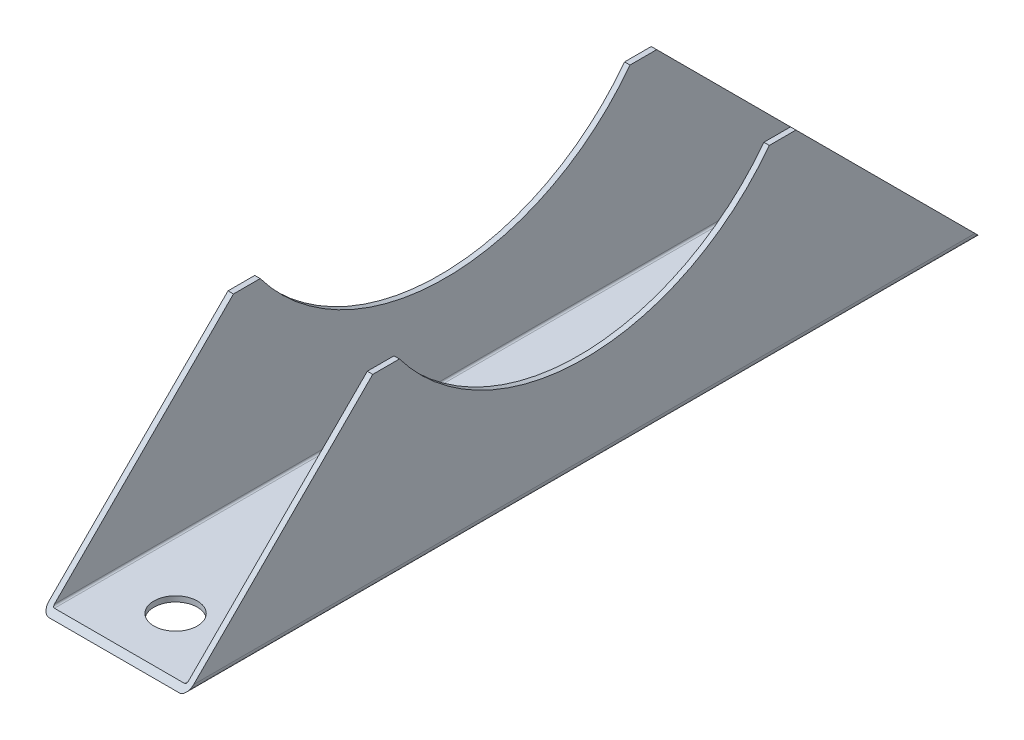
ISO-10303-21;
HEADER;
FILE_DESCRIPTION(('STEP AP214'),'2;1');
FILE_NAME('part.step','',(''),(''),'','','');
FILE_SCHEMA(('AUTOMOTIVE_DESIGN { 1 0 10303 214 1 1 1 1 }'));
ENDSEC;
DATA;
#1=APPLICATION_CONTEXT('core data for automotive mechanical design processes');
#2=APPLICATION_PROTOCOL_DEFINITION('international standard','automotive_design',2000,#1);
#3=PRODUCT_CONTEXT('',#1,'mechanical');
#4=PRODUCT('Part','Part','',(#3));
#5=PRODUCT_RELATED_PRODUCT_CATEGORY('part','',(#4));
#6=PRODUCT_DEFINITION_FORMATION('','',#4);
#7=PRODUCT_DEFINITION_CONTEXT('part definition',#1,'design');
#8=PRODUCT_DEFINITION('design','',#6,#7);
#9=PRODUCT_DEFINITION_SHAPE('','',#8);
#10=(LENGTH_UNIT() NAMED_UNIT(*) SI_UNIT(.MILLI.,.METRE.));
#11=(NAMED_UNIT(*) PLANE_ANGLE_UNIT() SI_UNIT($,.RADIAN.));
#12=(NAMED_UNIT(*) SI_UNIT($,.STERADIAN.) SOLID_ANGLE_UNIT());
#13=UNCERTAINTY_MEASURE_WITH_UNIT(LENGTH_MEASURE(1.E-05),#10,'distance_accuracy_value','');
#14=(GEOMETRIC_REPRESENTATION_CONTEXT(3) GLOBAL_UNCERTAINTY_ASSIGNED_CONTEXT((#13)) GLOBAL_UNIT_ASSIGNED_CONTEXT((#10,
#11,#12)) REPRESENTATION_CONTEXT('',''));
#15=CARTESIAN_POINT('',(0.,0.,0.));
#16=DIRECTION('',(0.,0.,1.));
#17=DIRECTION('',(1.,0.,0.));
#18=AXIS2_PLACEMENT_3D('',#15,#16,#17);
#19=CARTESIAN_POINT('',(18.5,51.5,110.));
#20=DIRECTION('',(0.,-1.,0.));
#21=DIRECTION('',(0.,0.,-1.));
#22=AXIS2_PLACEMENT_3D('',#19,#20,#21);
#23=PLANE('',#22);
#24=DIRECTION('',(0.,0.,-1.));
#25=VECTOR('',#24,1.);
#26=CARTESIAN_POINT('',(18.5,51.5,110.));
#27=LINE('',#26,#25);
#28=CARTESIAN_POINT('',(18.5,51.5,-51.1248471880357));
#29=VERTEX_POINT('',#28);
#30=CARTESIAN_POINT('',(18.5,51.5,-58.5000000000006));
#31=VERTEX_POINT('',#30);
#32=EDGE_CURVE('E181',#29,#31,#27,.T.);
#33=ORIENTED_EDGE('',*,*,#32,.F.);
#34=DIRECTION('',(1.,0.,0.));
#35=VECTOR('',#34,1.);
#36=CARTESIAN_POINT('',(-20.0000000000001,51.5,-51.1248471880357));
#37=LINE('',#36,#35);
#38=CARTESIAN_POINT('',(20.,51.5,-51.1248471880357));
#39=VERTEX_POINT('',#38);
#40=EDGE_CURVE('E155',#29,#39,#37,.T.);
#41=ORIENTED_EDGE('',*,*,#40,.T.);
#42=DIRECTION('',(0.,0.,-1.));
#43=VECTOR('',#42,1.);
#44=CARTESIAN_POINT('',(20.,51.5,110.));
#45=LINE('',#44,#43);
#46=CARTESIAN_POINT('',(20.,51.5,-58.5000000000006));
#47=VERTEX_POINT('',#46);
#48=EDGE_CURVE('E185',#39,#47,#45,.T.);
#49=ORIENTED_EDGE('',*,*,#48,.T.);
#50=DIRECTION('',(1.,0.,0.));
#51=VECTOR('',#50,1.);
#52=CARTESIAN_POINT('',(-20.0000000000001,51.5,-58.5000000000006));
#53=LINE('',#52,#51);
#54=EDGE_CURVE('E275',#31,#47,#53,.T.);
#55=ORIENTED_EDGE('',*,*,#54,.F.);
#56=EDGE_LOOP('',(#33,#41,#49,#55));
#57=FACE_BOUND('',#56,.T.);
#58=ADVANCED_FACE('F32',(#57),#23,.F.);
#59=CARTESIAN_POINT('',(-20.,51.5,110.));
#60=DIRECTION('',(0.,-1.,0.));
#61=DIRECTION('',(0.,0.,-1.));
#62=AXIS2_PLACEMENT_3D('',#59,#60,#61);
#63=PLANE('',#62);
#64=DIRECTION('',(0.,0.,-1.));
#65=VECTOR('',#64,1.);
#66=CARTESIAN_POINT('',(-20.,51.5,110.));
#67=LINE('',#66,#65);
#68=CARTESIAN_POINT('',(-20.,51.5,-51.1248471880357));
#69=VERTEX_POINT('',#68);
#70=CARTESIAN_POINT('',(-20.0000000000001,51.5,-58.5000000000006));
#71=VERTEX_POINT('',#70);
#72=EDGE_CURVE('E173',#69,#71,#67,.T.);
#73=ORIENTED_EDGE('',*,*,#72,.F.);
#74=CARTESIAN_POINT('',(-18.5,51.5,-51.1248471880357));
#75=VERTEX_POINT('',#74);
#76=EDGE_CURVE('E151',#69,#75,#37,.T.);
#77=ORIENTED_EDGE('',*,*,#76,.T.);
#78=DIRECTION('',(0.,0.,-1.));
#79=VECTOR('',#78,1.);
#80=CARTESIAN_POINT('',(-18.5,51.5,110.));
#81=LINE('',#80,#79);
#82=CARTESIAN_POINT('',(-18.5,51.5,-58.5000000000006));
#83=VERTEX_POINT('',#82);
#84=EDGE_CURVE('E172',#75,#83,#81,.T.);
#85=ORIENTED_EDGE('',*,*,#84,.T.);
#86=EDGE_CURVE('E272',#71,#83,#53,.T.);
#87=ORIENTED_EDGE('',*,*,#86,.F.);
#88=EDGE_LOOP('',(#73,#77,#85,#87));
#89=FACE_BOUND('',#88,.T.);
#90=ADVANCED_FACE('F328',(#89),#63,.F.);
#91=CARTESIAN_POINT('',(-18.5,1.49999999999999,110.));
#92=DIRECTION('',(0.,-1.,0.));
#93=DIRECTION('',(1.,0.,0.));
#94=AXIS2_PLACEMENT_3D('',#91,#92,#93);
#95=PLANE('',#94);
#96=DIRECTION('',(1.,0.,0.));
#97=VECTOR('',#96,1.);
#98=CARTESIAN_POINT('',(-18.5,1.49999999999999,108.5));
#99=LINE('',#98,#97);
#100=CARTESIAN_POINT('',(-18.,1.49999999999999,108.5));
#101=VERTEX_POINT('',#100);
#102=CARTESIAN_POINT('',(18.,1.50000000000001,108.5));
#103=VERTEX_POINT('',#102);
#104=EDGE_CURVE('E245',#101,#103,#99,.T.);
#105=ORIENTED_EDGE('',*,*,#104,.T.);
#106=DIRECTION('',(0.,0.,-1.));
#107=VECTOR('',#106,1.);
#108=CARTESIAN_POINT('',(18.,1.50000000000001,-108.5));
#109=LINE('',#108,#107);
#110=CARTESIAN_POINT('',(18.,1.50000000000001,-108.5));
#111=VERTEX_POINT('',#110);
#112=EDGE_CURVE('E191',#103,#111,#109,.T.);
#113=ORIENTED_EDGE('',*,*,#112,.T.);
#114=DIRECTION('',(1.,0.,0.));
#115=VECTOR('',#114,1.);
#116=CARTESIAN_POINT('',(-18.5,1.49999999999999,-108.5));
#117=LINE('',#116,#115);
#118=CARTESIAN_POINT('',(-18.,1.49999999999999,-108.5));
#119=VERTEX_POINT('',#118);
#120=EDGE_CURVE('E266',#119,#111,#117,.T.);
#121=ORIENTED_EDGE('',*,*,#120,.F.);
#122=DIRECTION('',(0.,0.,-1.));
#123=VECTOR('',#122,1.);
#124=CARTESIAN_POINT('',(-18.,1.49999999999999,108.5));
#125=LINE('',#124,#123);
#126=EDGE_CURVE('E189',#119,#101,#125,.F.);
#127=ORIENTED_EDGE('',*,*,#126,.T.);
#128=EDGE_LOOP('',(#105,#113,#121,#127));
#129=FACE_BOUND('',#128,.T.);
#130=CARTESIAN_POINT('',(0.,1.5,93.));
#131=DIRECTION('',(0.,1.,0.));
#132=DIRECTION('',(-1.,0.,0.));
#133=AXIS2_PLACEMENT_3D('',#130,#131,#132);
#134=CIRCLE('',#133,6.);
#135=CARTESIAN_POINT('',(-6.,1.5,93.));
#136=VERTEX_POINT('',#135);
#137=EDGE_CURVE('E261',#136,#136,#134,.T.);
#138=ORIENTED_EDGE('',*,*,#137,.F.);
#139=EDGE_LOOP('',(#138));
#140=FACE_BOUND('',#139,.T.);
#141=CARTESIAN_POINT('',(0.,1.5,-93.));
#142=DIRECTION('',(0.,-1.,0.));
#143=DIRECTION('',(-1.,0.,0.));
#144=AXIS2_PLACEMENT_3D('',#141,#142,#143);
#145=CIRCLE('',#144,6.);
#146=CARTESIAN_POINT('',(-6.,1.5,-93.));
#147=VERTEX_POINT('',#146);
#148=EDGE_CURVE('E278',#147,#147,#145,.T.);
#149=ORIENTED_EDGE('',*,*,#148,.T.);
#150=EDGE_LOOP('',(#149));
#151=FACE_BOUND('',#150,.T.);
#152=ADVANCED_FACE('F313',(#129,#140,#151),#95,.F.);
#153=CARTESIAN_POINT('',(20.,0.,110.));
#154=DIRECTION('',(0.,1.,0.));
#155=DIRECTION('',(-1.,0.,0.));
#156=AXIS2_PLACEMENT_3D('',#153,#154,#155);
#157=PLANE('',#156);
#158=DIRECTION('',(1.,0.,0.));
#159=VECTOR('',#158,1.);
#160=CARTESIAN_POINT('',(20.,0.,-110.));
#161=LINE('',#160,#159);
#162=CARTESIAN_POINT('',(-18.,0.,-110.));
#163=VERTEX_POINT('',#162);
#164=CARTESIAN_POINT('',(18.,0.,-110.));
#165=VERTEX_POINT('',#164);
#166=EDGE_CURVE('E178',#163,#165,#161,.T.);
#167=ORIENTED_EDGE('',*,*,#166,.T.);
#168=DIRECTION('',(0.,0.,-1.));
#169=VECTOR('',#168,1.);
#170=CARTESIAN_POINT('',(18.,0.,110.));
#171=LINE('',#170,#169);
#172=CARTESIAN_POINT('',(18.,0.,110.));
#173=VERTEX_POINT('',#172);
#174=EDGE_CURVE('E53',#165,#173,#171,.F.);
#175=ORIENTED_EDGE('',*,*,#174,.T.);
#176=DIRECTION('',(1.,0.,0.));
#177=VECTOR('',#176,1.);
#178=CARTESIAN_POINT('',(20.,0.,110.));
#179=LINE('',#178,#177);
#180=CARTESIAN_POINT('',(-18.,0.,110.));
#181=VERTEX_POINT('',#180);
#182=EDGE_CURVE('E176',#181,#173,#179,.T.);
#183=ORIENTED_EDGE('',*,*,#182,.F.);
#184=DIRECTION('',(0.,0.,-1.));
#185=VECTOR('',#184,1.);
#186=CARTESIAN_POINT('',(-18.,0.,110.));
#187=LINE('',#186,#185);
#188=EDGE_CURVE('E214',#181,#163,#187,.T.);
#189=ORIENTED_EDGE('',*,*,#188,.T.);
#190=EDGE_LOOP('',(#167,#175,#183,#189));
#191=FACE_BOUND('',#190,.T.);
#192=CARTESIAN_POINT('',(0.,0.,93.));
#193=DIRECTION('',(0.,1.,0.));
#194=DIRECTION('',(-1.,0.,0.));
#195=AXIS2_PLACEMENT_3D('',#192,#193,#194);
#196=CIRCLE('',#195,6.);
#197=CARTESIAN_POINT('',(-6.,0.,93.));
#198=VERTEX_POINT('',#197);
#199=EDGE_CURVE('E233',#198,#198,#196,.F.);
#200=ORIENTED_EDGE('',*,*,#199,.F.);
#201=EDGE_LOOP('',(#200));
#202=FACE_BOUND('',#201,.T.);
#203=CARTESIAN_POINT('',(0.,0.,-93.));
#204=DIRECTION('',(0.,1.,0.));
#205=DIRECTION('',(-1.,0.,0.));
#206=AXIS2_PLACEMENT_3D('',#203,#204,#205);
#207=CIRCLE('',#206,6.);
#208=CARTESIAN_POINT('',(-6.,0.,-93.));
#209=VERTEX_POINT('',#208);
#210=EDGE_CURVE('E280',#209,#209,#207,.T.);
#211=ORIENTED_EDGE('',*,*,#210,.T.);
#212=EDGE_LOOP('',(#211));
#213=FACE_BOUND('',#212,.T.);
#214=ADVANCED_FACE('F241',(#191,#202,#213),#157,.F.);
#215=CARTESIAN_POINT('',(20.,51.5,110.));
#216=DIRECTION('',(-1.,0.,0.));
#217=DIRECTION('',(0.,-1.,0.));
#218=AXIS2_PLACEMENT_3D('',#215,#216,#217);
#219=PLANE('',#218);
#220=DIRECTION('',(0.,0.707106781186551,-0.707106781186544));
#221=VECTOR('',#220,1.);
#222=CARTESIAN_POINT('',(20.,51.5,58.5000000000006));
#223=LINE('',#222,#221);
#224=CARTESIAN_POINT('',(20.,2.,108.));
#225=VERTEX_POINT('',#224);
#226=CARTESIAN_POINT('',(20.,51.5,58.5000000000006));
#227=VERTEX_POINT('',#226);
#228=EDGE_CURVE('E224',#225,#227,#223,.T.);
#229=ORIENTED_EDGE('',*,*,#228,.F.);
#230=DIRECTION('',(0.,0.,-1.));
#231=VECTOR('',#230,1.);
#232=CARTESIAN_POINT('',(20.,2.00000000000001,110.));
#233=LINE('',#232,#231);
#234=CARTESIAN_POINT('',(20.,2.,-108.));
#235=VERTEX_POINT('',#234);
#236=EDGE_CURVE('E207',#225,#235,#233,.T.);
#237=ORIENTED_EDGE('',*,*,#236,.T.);
#238=DIRECTION('',(0.,0.707106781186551,0.707106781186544));
#239=VECTOR('',#238,1.);
#240=CARTESIAN_POINT('',(20.,51.5,-58.5000000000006));
#241=LINE('',#240,#239);
#242=EDGE_CURVE('E240',#235,#47,#241,.T.);
#243=ORIENTED_EDGE('',*,*,#242,.T.);
#244=ORIENTED_EDGE('',*,*,#48,.F.);
#245=CARTESIAN_POINT('',(20.,90.,0.));
#246=DIRECTION('',(1.,0.,0.));
#247=DIRECTION('',(0.,1.,0.));
#248=AXIS2_PLACEMENT_3D('',#245,#246,#247);
#249=CIRCLE('',#248,64.);
#250=CARTESIAN_POINT('',(20.,51.5,51.1248471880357));
#251=VERTEX_POINT('',#250);
#252=EDGE_CURVE('E156',#251,#39,#249,.T.);
#253=ORIENTED_EDGE('',*,*,#252,.F.);
#254=EDGE_CURVE('E186',#227,#251,#45,.T.);
#255=ORIENTED_EDGE('',*,*,#254,.F.);
#256=EDGE_LOOP('',(#229,#237,#243,#244,#253,#255));
#257=FACE_BOUND('',#256,.T.);
#258=ADVANCED_FACE('F230',(#257),#219,.F.);
#259=ORIENTED_EDGE('',*,*,#254,.T.);
#260=DIRECTION('',(1.,0.,0.));
#261=VECTOR('',#260,1.);
#262=CARTESIAN_POINT('',(-20.0000000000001,51.5,51.1248471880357));
#263=LINE('',#262,#261);
#264=CARTESIAN_POINT('',(18.5,51.5,51.1248471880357));
#265=VERTEX_POINT('',#264);
#266=EDGE_CURVE('E167',#265,#251,#263,.T.);
#267=ORIENTED_EDGE('',*,*,#266,.F.);
#268=CARTESIAN_POINT('',(18.5,51.5,58.5000000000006));
#269=VERTEX_POINT('',#268);
#270=EDGE_CURVE('E182',#269,#265,#27,.T.);
#271=ORIENTED_EDGE('',*,*,#270,.F.);
#272=DIRECTION('',(1.,0.,0.));
#273=VECTOR('',#272,1.);
#274=CARTESIAN_POINT('',(-20.,51.5,58.5000000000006));
#275=LINE('',#274,#273);
#276=EDGE_CURVE('E256',#269,#227,#275,.T.);
#277=ORIENTED_EDGE('',*,*,#276,.T.);
#278=EDGE_LOOP('',(#259,#267,#271,#277));
#279=FACE_BOUND('',#278,.T.);
#280=ADVANCED_FACE('F305',(#279),#23,.F.);
#281=CARTESIAN_POINT('',(18.5,1.50000000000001,110.));
#282=DIRECTION('',(1.,0.,0.));
#283=DIRECTION('',(0.,1.,0.));
#284=AXIS2_PLACEMENT_3D('',#281,#282,#283);
#285=PLANE('',#284);
#286=DIRECTION('',(0.,0.707106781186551,0.707106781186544));
#287=VECTOR('',#286,1.);
#288=CARTESIAN_POINT('',(18.4999999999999,110.75,0.749999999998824));
#289=LINE('',#288,#287);
#290=CARTESIAN_POINT('',(18.5,1.99999999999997,-108.));
#291=VERTEX_POINT('',#290);
#292=EDGE_CURVE('E264',#291,#31,#289,.T.);
#293=ORIENTED_EDGE('',*,*,#292,.F.);
#294=DIRECTION('',(0.,0.,-1.));
#295=VECTOR('',#294,1.);
#296=CARTESIAN_POINT('',(18.5,2.00000000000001,108.5));
#297=LINE('',#296,#295);
#298=CARTESIAN_POINT('',(18.5,2.,108.));
#299=VERTEX_POINT('',#298);
#300=EDGE_CURVE('E194',#291,#299,#297,.F.);
#301=ORIENTED_EDGE('',*,*,#300,.T.);
#302=DIRECTION('',(0.,0.707106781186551,-0.707106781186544));
#303=VECTOR('',#302,1.);
#304=CARTESIAN_POINT('',(18.5,0.750000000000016,109.25));
#305=LINE('',#304,#303);
#306=EDGE_CURVE('E244',#299,#269,#305,.T.);
#307=ORIENTED_EDGE('',*,*,#306,.T.);
#308=ORIENTED_EDGE('',*,*,#270,.T.);
#309=CARTESIAN_POINT('',(18.5,90.,0.));
#310=DIRECTION('',(1.,0.,0.));
#311=DIRECTION('',(0.,1.,0.));
#312=AXIS2_PLACEMENT_3D('',#309,#310,#311);
#313=CIRCLE('',#312,64.);
#314=EDGE_CURVE('E283',#265,#29,#313,.T.);
#315=ORIENTED_EDGE('',*,*,#314,.T.);
#316=ORIENTED_EDGE('',*,*,#32,.T.);
#317=EDGE_LOOP('',(#293,#301,#307,#308,#315,#316));
#318=FACE_BOUND('',#317,.T.);
#319=ADVANCED_FACE('F301',(#318),#285,.F.);
#320=CARTESIAN_POINT('',(-18.5,51.5,110.));
#321=DIRECTION('',(-1.,0.,0.));
#322=DIRECTION('',(0.,-1.,0.));
#323=AXIS2_PLACEMENT_3D('',#320,#321,#322);
#324=PLANE('',#323);
#325=DIRECTION('',(0.,-0.707106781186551,0.707106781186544));
#326=VECTOR('',#325,1.);
#327=CARTESIAN_POINT('',(-18.5,25.7500000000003,84.25));
#328=LINE('',#327,#326);
#329=CARTESIAN_POINT('',(-18.5,51.5,58.5000000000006));
#330=VERTEX_POINT('',#329);
#331=CARTESIAN_POINT('',(-18.5,1.99999999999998,108.));
#332=VERTEX_POINT('',#331);
#333=EDGE_CURVE('E250',#330,#332,#328,.T.);
#334=ORIENTED_EDGE('',*,*,#333,.T.);
#335=DIRECTION('',(0.,0.,-1.));
#336=VECTOR('',#335,1.);
#337=CARTESIAN_POINT('',(-18.5,1.99999999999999,-108.5));
#338=LINE('',#337,#336);
#339=CARTESIAN_POINT('',(-18.5,1.99999999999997,-108.));
#340=VERTEX_POINT('',#339);
#341=EDGE_CURVE('E196',#332,#340,#338,.T.);
#342=ORIENTED_EDGE('',*,*,#341,.T.);
#343=DIRECTION('',(0.,-0.707106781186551,-0.707106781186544));
#344=VECTOR('',#343,1.);
#345=CARTESIAN_POINT('',(-18.5,135.75,25.7499999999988));
#346=LINE('',#345,#344);
#347=EDGE_CURVE('E269',#83,#340,#346,.T.);
#348=ORIENTED_EDGE('',*,*,#347,.F.);
#349=ORIENTED_EDGE('',*,*,#84,.F.);
#350=CARTESIAN_POINT('',(-18.5,90.,0.));
#351=DIRECTION('',(-1.,0.,0.));
#352=DIRECTION('',(0.,-1.,0.));
#353=AXIS2_PLACEMENT_3D('',#350,#351,#352);
#354=CIRCLE('',#353,64.);
#355=CARTESIAN_POINT('',(-18.5,51.5,51.1248471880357));
#356=VERTEX_POINT('',#355);
#357=EDGE_CURVE('E166',#75,#356,#354,.T.);
#358=ORIENTED_EDGE('',*,*,#357,.T.);
#359=EDGE_CURVE('E165',#330,#356,#81,.T.);
#360=ORIENTED_EDGE('',*,*,#359,.F.);
#361=EDGE_LOOP('',(#334,#342,#348,#349,#358,#360));
#362=FACE_BOUND('',#361,.T.);
#363=ADVANCED_FACE('F322',(#362),#324,.F.);
#364=ORIENTED_EDGE('',*,*,#359,.T.);
#365=CARTESIAN_POINT('',(-20.0000000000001,51.5,51.1248471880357));
#366=VERTEX_POINT('',#365);
#367=EDGE_CURVE('E148',#366,#356,#263,.T.);
#368=ORIENTED_EDGE('',*,*,#367,.F.);
#369=CARTESIAN_POINT('',(-20.,51.5,58.5000000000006));
#370=VERTEX_POINT('',#369);
#371=EDGE_CURVE('E163',#370,#366,#67,.T.);
#372=ORIENTED_EDGE('',*,*,#371,.F.);
#373=EDGE_CURVE('E255',#370,#330,#275,.T.);
#374=ORIENTED_EDGE('',*,*,#373,.T.);
#375=EDGE_LOOP('',(#364,#368,#372,#374));
#376=FACE_BOUND('',#375,.T.);
#377=ADVANCED_FACE('F161',(#376),#63,.F.);
#378=CARTESIAN_POINT('',(-20.,0.,110.));
#379=DIRECTION('',(1.,0.,0.));
#380=DIRECTION('',(0.,1.,0.));
#381=AXIS2_PLACEMENT_3D('',#378,#379,#380);
#382=PLANE('',#381);
#383=DIRECTION('',(0.,0.707106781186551,0.707106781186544));
#384=VECTOR('',#383,1.);
#385=CARTESIAN_POINT('',(-20.0000000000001,51.5,-58.5000000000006));
#386=LINE('',#385,#384);
#387=CARTESIAN_POINT('',(-20.,1.99999999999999,-108.));
#388=VERTEX_POINT('',#387);
#389=EDGE_CURVE('E277',#388,#71,#386,.T.);
#390=ORIENTED_EDGE('',*,*,#389,.F.);
#391=DIRECTION('',(0.,0.,-1.));
#392=VECTOR('',#391,1.);
#393=CARTESIAN_POINT('',(-20.,2.,110.));
#394=LINE('',#393,#392);
#395=CARTESIAN_POINT('',(-20.,1.99999999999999,108.));
#396=VERTEX_POINT('',#395);
#397=EDGE_CURVE('E11',#388,#396,#394,.F.);
#398=ORIENTED_EDGE('',*,*,#397,.T.);
#399=DIRECTION('',(0.,0.707106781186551,-0.707106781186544));
#400=VECTOR('',#399,1.);
#401=CARTESIAN_POINT('',(-20.,51.5,58.5000000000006));
#402=LINE('',#401,#400);
#403=EDGE_CURVE('E170',#396,#370,#402,.T.);
#404=ORIENTED_EDGE('',*,*,#403,.T.);
#405=ORIENTED_EDGE('',*,*,#371,.T.);
#406=CARTESIAN_POINT('',(-20.0000000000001,90.,0.));
#407=DIRECTION('',(1.,0.,0.));
#408=DIRECTION('',(0.,1.,0.));
#409=AXIS2_PLACEMENT_3D('',#406,#407,#408);
#410=CIRCLE('',#409,64.);
#411=EDGE_CURVE('E145',#366,#69,#410,.T.);
#412=ORIENTED_EDGE('',*,*,#411,.T.);
#413=ORIENTED_EDGE('',*,*,#72,.T.);
#414=EDGE_LOOP('',(#390,#398,#404,#405,#412,#413));
#415=FACE_BOUND('',#414,.T.);
#416=ADVANCED_FACE('F169',(#415),#382,.F.);
#417=CARTESIAN_POINT('',(-20.,51.5,58.5000000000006));
#418=DIRECTION('',(0.,-0.707106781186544,-0.707106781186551));
#419=DIRECTION('',(0.,0.707106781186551,-0.707106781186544));
#420=AXIS2_PLACEMENT_3D('',#417,#418,#419);
#421=PLANE('',#420);
#422=ORIENTED_EDGE('',*,*,#182,.T.);
#423=CARTESIAN_POINT('',(18.,2.00000000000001,108.));
#424=DIRECTION('',(0.,-0.707106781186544,-0.707106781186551));
#425=DIRECTION('',(0.,0.707106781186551,-0.707106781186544));
#426=AXIS2_PLACEMENT_3D('',#423,#424,#425);
#427=ELLIPSE('',#426,2.82842712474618,2.);
#428=EDGE_CURVE('E40',#173,#225,#427,.F.);
#429=ORIENTED_EDGE('',*,*,#428,.T.);
#430=ORIENTED_EDGE('',*,*,#228,.T.);
#431=ORIENTED_EDGE('',*,*,#276,.F.);
#432=ORIENTED_EDGE('',*,*,#306,.F.);
#433=CARTESIAN_POINT('',(18.,2.00000000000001,108.));
#434=DIRECTION('',(0.,-0.707106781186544,-0.707106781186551));
#435=DIRECTION('',(0.,-0.707106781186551,0.707106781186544));
#436=AXIS2_PLACEMENT_3D('',#433,#434,#435);
#437=ELLIPSE('',#436,0.707106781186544,0.5);
#438=EDGE_CURVE('E201',#299,#103,#437,.T.);
#439=ORIENTED_EDGE('',*,*,#438,.T.);
#440=ORIENTED_EDGE('',*,*,#104,.F.);
#441=CARTESIAN_POINT('',(-18.,1.99999999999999,108.));
#442=DIRECTION('',(0.,-0.707106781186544,-0.707106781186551));
#443=DIRECTION('',(0.,-0.707106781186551,0.707106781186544));
#444=AXIS2_PLACEMENT_3D('',#441,#442,#443);
#445=ELLIPSE('',#444,0.707106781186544,0.5);
#446=EDGE_CURVE('E205',#101,#332,#445,.T.);
#447=ORIENTED_EDGE('',*,*,#446,.T.);
#448=ORIENTED_EDGE('',*,*,#333,.F.);
#449=ORIENTED_EDGE('',*,*,#373,.F.);
#450=ORIENTED_EDGE('',*,*,#403,.F.);
#451=CARTESIAN_POINT('',(-18.,2.,108.));
#452=DIRECTION('',(0.,-0.707106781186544,-0.707106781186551));
#453=DIRECTION('',(0.,0.707106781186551,-0.707106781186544));
#454=AXIS2_PLACEMENT_3D('',#451,#452,#453);
#455=ELLIPSE('',#454,2.82842712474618,2.);
#456=EDGE_CURVE('E218',#396,#181,#455,.F.);
#457=ORIENTED_EDGE('',*,*,#456,.T.);
#458=EDGE_LOOP('',(#422,#429,#430,#431,#432,#439,#440,#447,#448,#449,#450,#457));
#459=FACE_BOUND('',#458,.T.);
#460=ADVANCED_FACE('F222',(#459),#421,.F.);
#461=CARTESIAN_POINT('',(0.,-0.00100000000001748,93.));
#462=DIRECTION('',(0.,1.,0.));
#463=DIRECTION('',(-1.,0.,0.));
#464=AXIS2_PLACEMENT_3D('',#461,#462,#463);
#465=CYLINDRICAL_SURFACE('',#464,6.);
#466=ORIENTED_EDGE('',*,*,#137,.T.);
#467=EDGE_LOOP('',(#466));
#468=FACE_BOUND('',#467,.T.);
#469=ORIENTED_EDGE('',*,*,#199,.T.);
#470=EDGE_LOOP('',(#469));
#471=FACE_BOUND('',#470,.T.);
#472=ADVANCED_FACE('F378',(#468,#471),#465,.F.);
#473=CARTESIAN_POINT('',(-20.0000000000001,51.5,-58.5000000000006));
#474=DIRECTION('',(0.,0.707106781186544,-0.707106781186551));
#475=DIRECTION('',(0.,0.707106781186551,0.707106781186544));
#476=AXIS2_PLACEMENT_3D('',#473,#474,#475);
#477=PLANE('',#476);
#478=ORIENTED_EDGE('',*,*,#242,.F.);
#479=CARTESIAN_POINT('',(18.,2.00000000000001,-108.));
#480=DIRECTION('',(0.,0.707106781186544,-0.707106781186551));
#481=DIRECTION('',(0.,-0.707106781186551,-0.707106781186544));
#482=AXIS2_PLACEMENT_3D('',#479,#480,#481);
#483=ELLIPSE('',#482,2.82842712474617,2.);
#484=EDGE_CURVE('E212',#235,#165,#483,.T.);
#485=ORIENTED_EDGE('',*,*,#484,.T.);
#486=ORIENTED_EDGE('',*,*,#166,.F.);
#487=CARTESIAN_POINT('',(-18.,2.,-108.));
#488=DIRECTION('',(0.,0.707106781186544,-0.707106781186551));
#489=DIRECTION('',(0.,-0.707106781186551,-0.707106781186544));
#490=AXIS2_PLACEMENT_3D('',#487,#488,#489);
#491=ELLIPSE('',#490,2.82842712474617,2.);
#492=EDGE_CURVE('E210',#163,#388,#491,.T.);
#493=ORIENTED_EDGE('',*,*,#492,.T.);
#494=ORIENTED_EDGE('',*,*,#389,.T.);
#495=ORIENTED_EDGE('',*,*,#86,.T.);
#496=ORIENTED_EDGE('',*,*,#347,.T.);
#497=CARTESIAN_POINT('',(-18.,1.99999999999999,-108.));
#498=DIRECTION('',(0.,0.707106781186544,-0.707106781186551));
#499=DIRECTION('',(0.,0.707106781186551,0.707106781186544));
#500=AXIS2_PLACEMENT_3D('',#497,#498,#499);
#501=ELLIPSE('',#500,0.707106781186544,0.5);
#502=EDGE_CURVE('E203',#340,#119,#501,.F.);
#503=ORIENTED_EDGE('',*,*,#502,.T.);
#504=ORIENTED_EDGE('',*,*,#120,.T.);
#505=CARTESIAN_POINT('',(18.,2.00000000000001,-108.));
#506=DIRECTION('',(0.,0.707106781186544,-0.707106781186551));
#507=DIRECTION('',(0.,0.707106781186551,0.707106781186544));
#508=AXIS2_PLACEMENT_3D('',#505,#506,#507);
#509=ELLIPSE('',#508,0.707106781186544,0.5);
#510=EDGE_CURVE('E199',#111,#291,#509,.F.);
#511=ORIENTED_EDGE('',*,*,#510,.T.);
#512=ORIENTED_EDGE('',*,*,#292,.T.);
#513=ORIENTED_EDGE('',*,*,#54,.T.);
#514=EDGE_LOOP('',(#478,#485,#486,#493,#494,#495,#496,#503,#504,#511,#512,#513));
#515=FACE_BOUND('',#514,.T.);
#516=ADVANCED_FACE('F238',(#515),#477,.T.);
#517=CARTESIAN_POINT('',(0.,-0.00100000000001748,-93.));
#518=DIRECTION('',(0.,1.,0.));
#519=DIRECTION('',(-1.,0.,0.));
#520=AXIS2_PLACEMENT_3D('',#517,#518,#519);
#521=CYLINDRICAL_SURFACE('',#520,6.);
#522=ORIENTED_EDGE('',*,*,#148,.F.);
#523=EDGE_LOOP('',(#522));
#524=FACE_BOUND('',#523,.T.);
#525=ORIENTED_EDGE('',*,*,#210,.F.);
#526=EDGE_LOOP('',(#525));
#527=FACE_BOUND('',#526,.T.);
#528=ADVANCED_FACE('F377',(#524,#527),#521,.F.);
#529=CARTESIAN_POINT('',(-20.0000000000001,90.,0.));
#530=DIRECTION('',(1.,0.,0.));
#531=DIRECTION('',(0.,1.,0.));
#532=AXIS2_PLACEMENT_3D('',#529,#530,#531);
#533=CYLINDRICAL_SURFACE('',#532,64.);
#534=ORIENTED_EDGE('',*,*,#76,.F.);
#535=ORIENTED_EDGE('',*,*,#411,.F.);
#536=ORIENTED_EDGE('',*,*,#367,.T.);
#537=ORIENTED_EDGE('',*,*,#357,.F.);
#538=EDGE_LOOP('',(#534,#535,#536,#537));
#539=FACE_BOUND('',#538,.T.);
#540=ADVANCED_FACE('F147',(#539),#533,.F.);
#541=ORIENTED_EDGE('',*,*,#266,.T.);
#542=ORIENTED_EDGE('',*,*,#252,.T.);
#543=ORIENTED_EDGE('',*,*,#40,.F.);
#544=ORIENTED_EDGE('',*,*,#314,.F.);
#545=EDGE_LOOP('',(#541,#542,#543,#544));
#546=FACE_BOUND('',#545,.T.);
#547=ADVANCED_FACE('F292',(#546),#533,.F.);
#548=CARTESIAN_POINT('',(18.,2.00000000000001,110.));
#549=DIRECTION('',(0.,0.,1.));
#550=DIRECTION('',(1.,0.,0.));
#551=AXIS2_PLACEMENT_3D('',#548,#549,#550);
#552=CYLINDRICAL_SURFACE('',#551,0.5);
#553=ORIENTED_EDGE('',*,*,#438,.F.);
#554=ORIENTED_EDGE('',*,*,#300,.F.);
#555=ORIENTED_EDGE('',*,*,#510,.F.);
#556=ORIENTED_EDGE('',*,*,#112,.F.);
#557=EDGE_LOOP('',(#553,#554,#555,#556));
#558=FACE_BOUND('',#557,.T.);
#559=ADVANCED_FACE('F310',(#558),#552,.F.);
#560=CARTESIAN_POINT('',(-18.,1.99999999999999,110.));
#561=DIRECTION('',(0.,0.,1.));
#562=DIRECTION('',(1.,0.,0.));
#563=AXIS2_PLACEMENT_3D('',#560,#561,#562);
#564=CYLINDRICAL_SURFACE('',#563,0.5);
#565=ORIENTED_EDGE('',*,*,#446,.F.);
#566=ORIENTED_EDGE('',*,*,#126,.F.);
#567=ORIENTED_EDGE('',*,*,#502,.F.);
#568=ORIENTED_EDGE('',*,*,#341,.F.);
#569=EDGE_LOOP('',(#565,#566,#567,#568));
#570=FACE_BOUND('',#569,.T.);
#571=ADVANCED_FACE('F320',(#570),#564,.F.);
#572=CARTESIAN_POINT('',(18.,2.00000000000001,110.));
#573=DIRECTION('',(0.,0.,-1.));
#574=DIRECTION('',(-1.,0.,0.));
#575=AXIS2_PLACEMENT_3D('',#572,#573,#574);
#576=CYLINDRICAL_SURFACE('',#575,2.);
#577=ORIENTED_EDGE('',*,*,#428,.F.);
#578=ORIENTED_EDGE('',*,*,#174,.F.);
#579=ORIENTED_EDGE('',*,*,#484,.F.);
#580=ORIENTED_EDGE('',*,*,#236,.F.);
#581=EDGE_LOOP('',(#577,#578,#579,#580));
#582=FACE_BOUND('',#581,.T.);
#583=ADVANCED_FACE('F235',(#582),#576,.T.);
#584=CARTESIAN_POINT('',(-18.,2.,110.));
#585=DIRECTION('',(0.,0.,-1.));
#586=DIRECTION('',(-1.,0.,0.));
#587=AXIS2_PLACEMENT_3D('',#584,#585,#586);
#588=CYLINDRICAL_SURFACE('',#587,2.);
#589=ORIENTED_EDGE('',*,*,#456,.F.);
#590=ORIENTED_EDGE('',*,*,#397,.F.);
#591=ORIENTED_EDGE('',*,*,#492,.F.);
#592=ORIENTED_EDGE('',*,*,#188,.F.);
#593=EDGE_LOOP('',(#589,#590,#591,#592));
#594=FACE_BOUND('',#593,.T.);
#595=ADVANCED_FACE('F34',(#594),#588,.T.);
#596=CLOSED_SHELL('',(#58,#90,#152,#214,#258,#280,#319,#363,#377,#416,#460,#472,#516,#528,#540,
#547,#559,#571,#583,#595));
#597=MANIFOLD_SOLID_BREP('B2',#596);
#598=ADVANCED_BREP_SHAPE_REPRESENTATION('',(#18,#597),#14);
#599=SHAPE_DEFINITION_REPRESENTATION(#9,#598);
ENDSEC;
END-ISO-10303-21;
